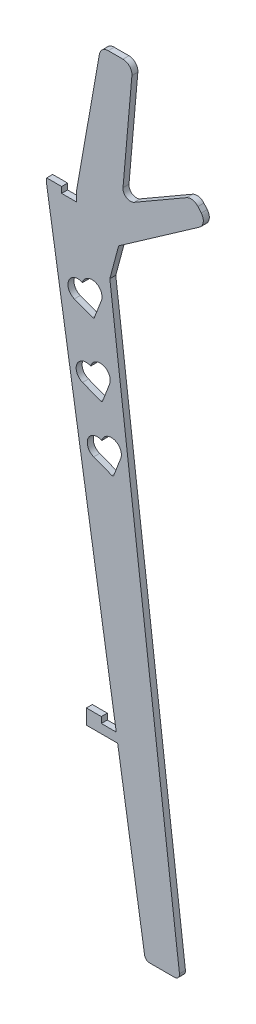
from build123d import *

# Parameters (mm, degrees)
BOSS_EXTRUDE2_DEPTH = 12
CUT_EXTRUDE1_DEPTH  = 12


with BuildPart() as part:
    # Sketch2 → Boss-Extrude2 (new body)
    with BuildSketch(Plane.XY):
        with BuildLine():
            Line((71.481499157, 1215.996631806), (53.797754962, 1150))
            Line((53.797754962, 1150), (193.622517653, 11.218693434))
            ThreePointArc((193.622517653, 11.218693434), (191.186613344, 3.373799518), (183.697056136, 0))
            Line((183.697056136, 0), (133.540806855, 0))
            ThreePointArc((133.540806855, 0), (127.046326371, 2.395940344), (123.663923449, 8.43565535))
            Line((123.663923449, 8.43565535), (69.565445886, 350))
            Line((69.565445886, 350), (6.714525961, 350))
            Line((6.714525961, 350), (6.714525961, 380))
            Line((6.714525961, 380), (36.714525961, 380))
            Line((36.714525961, 380), (36.714525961, 368))
            Line((36.714525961, 368), (66.714525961, 368))
            Line((66.714525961, 368), (-72.980550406, 1250))
            Line((-72.980550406, 1250), (-72.980550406, 1262))
            Line((-72.980550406, 1262), (-42.980550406, 1262))
            Line((-42.980550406, 1262), (-42.980550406, 1250))
            Line((-42.980550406, 1250), (-12.980550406, 1250))
            Line((-12.980550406, 1250), (-12.980550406, 1270))
            Line((-12.980550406, 1270), (32.886623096, 1530.125667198))
            ThreePointArc((32.886623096, 1530.125667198), (39.042985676, 1540.788799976), (50.61316265, 1545))
            Line((50.61316265, 1545), (80.186935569, 1545))
            ThreePointArc((80.186935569, 1545), (93.457927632, 1539.160623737), (98.118440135, 1525.431196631))
            Line((98.118440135, 1525.431196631), (80.288365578, 1321.632511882))
            ThreePointArc((80.288365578, 1321.632511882), (87.171791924, 1307.674304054), (102.731286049, 1307.334794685))
            Line((102.731286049, 1307.334794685), (207.885938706, 1368.045861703))
            ThreePointArc((207.885938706, 1368.045861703), (220.011605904, 1370.183943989), (230.674738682, 1364.027581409))
            Line((230.674738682, 1364.027581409), (237.373367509, 1356.044466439))
            ThreePointArc((237.373367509, 1356.044466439), (241.430575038, 1342.124818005), (233.908943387, 1329.729552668))
            Line((233.908943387, 1329.729552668), (71.481499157, 1215.996631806))
        make_face()
    extrude(amount=BOSS_EXTRUDE2_DEPTH)

    # Sketch3 → Cut-Extrude1 (cut)
    with BuildSketch(Plane.XY.offset(12)):
        with BuildLine():
            Line((-17.495515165, 1079.21076925), (18.914121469, 1065.234419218))
            ThreePointArc((18.914121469, 1065.234419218), (21.209435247, 1065.294524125), (22.789966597, 1066.960056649))
            Line((22.789966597, 1066.960056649), (36.766316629, 1103.369693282))
            ThreePointArc((36.766316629, 1103.369693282), (24.26489244, 1129.561479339), (-1.229324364, 1115.69280337))
            ThreePointArc((-1.229324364, 1115.69280337), (-28.594719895, 1106.026863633), (-17.495515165, 1079.21076925))
        make_face()
        with BuildLine():
            Line((-0.983985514, 942.233630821), (35.42565112, 928.257280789))
            ThreePointArc((35.42565112, 928.257280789), (37.720964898, 928.317385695), (39.301496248, 929.982918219))
            Line((39.301496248, 929.982918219), (53.27784628, 966.392554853))
            ThreePointArc((53.27784628, 966.392554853), (40.776422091, 992.58434091), (15.282205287, 978.715664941))
            ThreePointArc((15.282205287, 978.715664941), (-12.083190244, 969.049725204), (-0.983985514, 942.233630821))
        make_face()
        with BuildLine():
            Line((21.342578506, 823.986706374), (57.752215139, 810.010356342))
            ThreePointArc((57.752215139, 810.010356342), (60.047528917, 810.070461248), (61.628060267, 811.735993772))
            Line((61.628060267, 811.735993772), (75.604410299, 848.145630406))
            ThreePointArc((75.604410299, 848.145630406), (63.102986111, 874.337416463), (37.608769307, 860.468740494))
            ThreePointArc((37.608769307, 860.468740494), (10.243373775, 850.802800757), (21.342578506, 823.986706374))
        make_face()
    extrude(amount=-CUT_EXTRUDE1_DEPTH, mode=Mode.SUBTRACT)


solid = part.part
